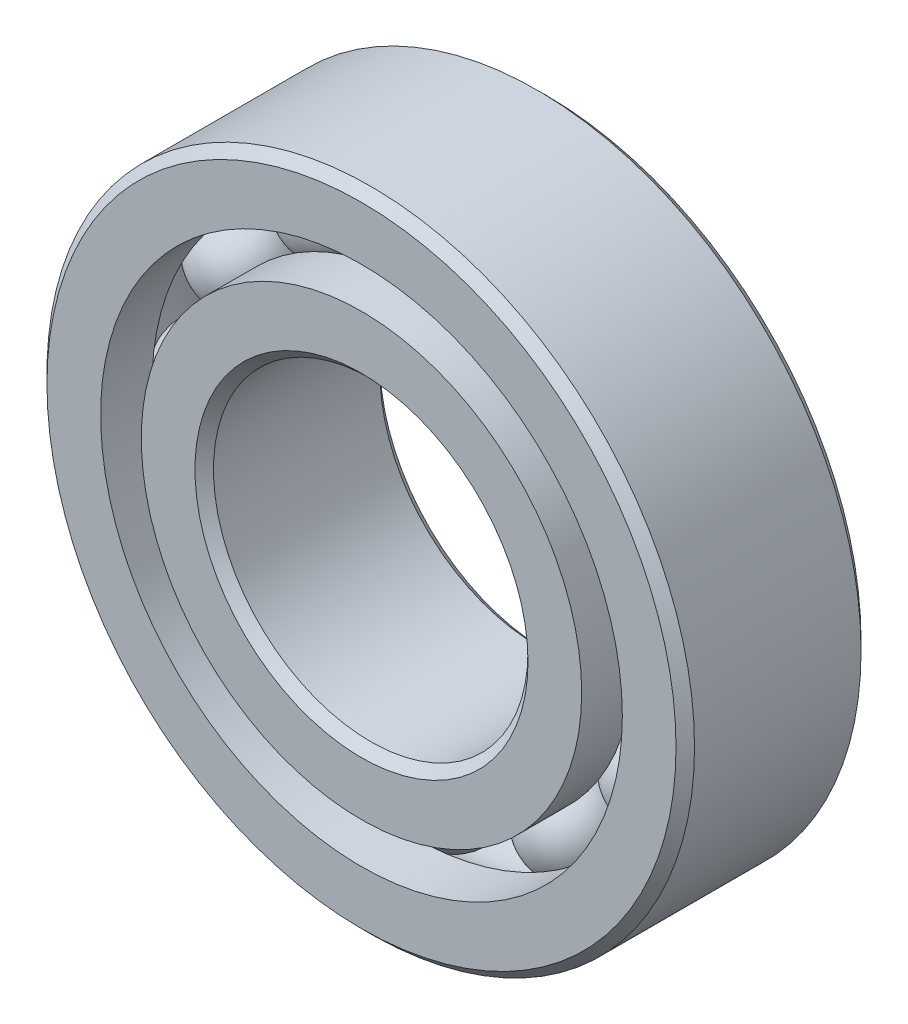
from build123d import *

# Parameters (mm, degrees)
CIRPATTERN1_COUNT = 12


with BuildPart() as part:
    # Sketch1 → Revolve1 (revolve)
    with BuildSketch(Plane(origin=(0, 0, 0), x_dir=(0, 0, -1), z_dir=(1, 0, 0)), mode=Mode.PRIVATE) as revolve1_sk:
        with BuildLine():
            Line((4.5, 17.5), (-4.5, 17.5))
            Line((-4.5, 17.5), (-5, 17))
            Line((-5, 17), (-5, 14.098901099))
            Line((-5, 14.098901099), (-2.222222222, 14.098901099))
            ThreePointArc((-2.222222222, 14.098901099), (0, 15.479083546), (2.222222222, 14.098901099))
            Line((2.222222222, 14.098901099), (5, 14.098901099))
            Line((5, 14.098901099), (5, 17))
            Line((5, 17), (4.5, 17.5))
        make_face()
    revolve(revolve1_sk.sketch.rotate(Axis((0, 0, 5), (0, 0, -1)), 90), axis=Axis((0, 0, 5), (0, 0, -1)))


with BuildPart() as body_2:
    # Sketch3 → Revolve3 (revolve)
    with BuildSketch(Plane(origin=(0, 0, 0), x_dir=(0, 0, -1), z_dir=(1, 0, 0)), mode=Mode.PRIVATE) as revolve3_sk:
        with BuildLine():
            Line((-5, 11.901098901), (-2.222222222, 11.901098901))
            ThreePointArc((-2.222222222, 11.901098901), (0, 10.520916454), (2.222222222, 11.901098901))
            Line((2.222222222, 11.901098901), (5, 11.901098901))
            Line((5, 11.901098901), (5, 9))
            Line((5, 9), (4.5, 8.5))
            Line((4.5, 8.5), (-4.5, 8.5))
            Line((-4.5, 8.5), (-5, 9))
            Line((-5, 9), (-5, 11.901098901))
        make_face()
    revolve(revolve3_sk.sketch.rotate(Axis((0, 0, 5), (0, 0, -1)), 90), axis=Axis((0, 0, 5), (0, 0, -1)))


with BuildPart() as body_3:
    # Sketch4 → Revolve4 (revolve)
    with BuildSketch(Plane(origin=(0, 0, 0), x_dir=(0, 0, -1), z_dir=(1, 0, 0))):
        with BuildLine():
            Line((-2.479083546, 13), (2.479083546, 13))
            ThreePointArc((2.479083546, 13), (0, 15.479083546), (-2.479083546, 13))
        make_face()
    revolve(axis=Axis((0, 13, 2.479083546), (0, 0, -1)))


with BuildPart() as cirpattern1_1:
    # CirPattern1: pattern copy
    add(body_3.part.rotate(Axis((0, 0, 0), (0, 0, 1)), 1 * 360 / CIRPATTERN1_COUNT))


with BuildPart() as cirpattern1_2:
    # CirPattern1: pattern copy
    add(body_3.part.rotate(Axis((0, 0, 0), (0, 0, 1)), 2 * 360 / CIRPATTERN1_COUNT))


with BuildPart() as cirpattern1_3:
    # CirPattern1: pattern copy
    add(body_3.part.rotate(Axis((0, 0, 0), (0, 0, 1)), 3 * 360 / CIRPATTERN1_COUNT))


with BuildPart() as cirpattern1_4:
    # CirPattern1: pattern copy
    add(body_3.part.rotate(Axis((0, 0, 0), (0, 0, 1)), 4 * 360 / CIRPATTERN1_COUNT))


with BuildPart() as cirpattern1_5:
    # CirPattern1: pattern copy
    add(body_3.part.rotate(Axis((0, 0, 0), (0, 0, 1)), 5 * 360 / CIRPATTERN1_COUNT))


with BuildPart() as cirpattern1_6:
    # CirPattern1: pattern copy
    add(body_3.part.rotate(Axis((0, 0, 0), (0, 0, 1)), 6 * 360 / CIRPATTERN1_COUNT))


with BuildPart() as cirpattern1_7:
    # CirPattern1: pattern copy
    add(body_3.part.rotate(Axis((0, 0, 0), (0, 0, 1)), 7 * 360 / CIRPATTERN1_COUNT))


with BuildPart() as cirpattern1_8:
    # CirPattern1: pattern copy
    add(body_3.part.rotate(Axis((0, 0, 0), (0, 0, 1)), 8 * 360 / CIRPATTERN1_COUNT))


with BuildPart() as cirpattern1_9:
    # CirPattern1: pattern copy
    add(body_3.part.rotate(Axis((0, 0, 0), (0, 0, 1)), 9 * 360 / CIRPATTERN1_COUNT))


with BuildPart() as cirpattern1_10:
    # CirPattern1: pattern copy
    add(body_3.part.rotate(Axis((0, 0, 0), (0, 0, 1)), 10 * 360 / CIRPATTERN1_COUNT))


with BuildPart() as cirpattern1_11:
    # CirPattern1: pattern copy
    add(body_3.part.rotate(Axis((0, 0, 0), (0, 0, 1)), 11 * 360 / CIRPATTERN1_COUNT))


solid = Compound([part.part, body_2.part, body_3.part, cirpattern1_1.part, cirpattern1_2.part, cirpattern1_3.part, cirpattern1_4.part, cirpattern1_5.part, cirpattern1_6.part, cirpattern1_7.part, cirpattern1_8.part, cirpattern1_9.part, cirpattern1_10.part, cirpattern1_11.part])
